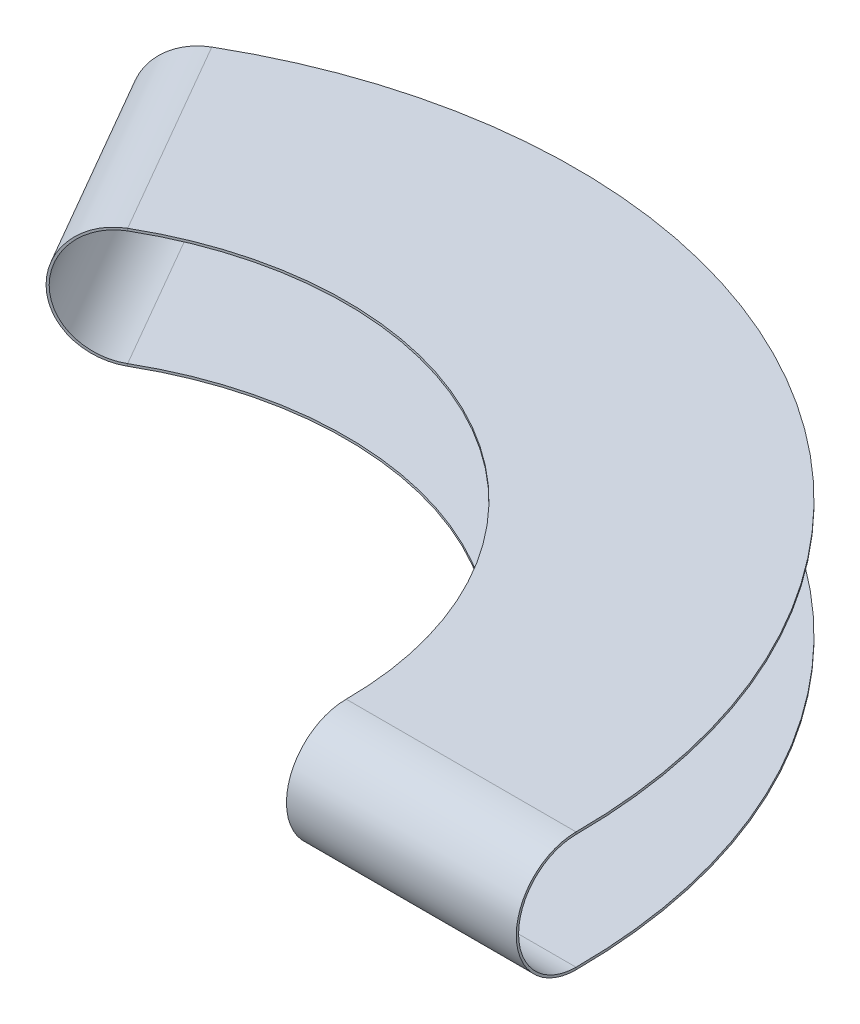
ISO-10303-21;
HEADER;
FILE_DESCRIPTION(('STEP AP214'),'2;1');
FILE_NAME('part.step','',(''),(''),'','','');
FILE_SCHEMA(('AUTOMOTIVE_DESIGN { 1 0 10303 214 1 1 1 1 }'));
ENDSEC;
DATA;
#1=APPLICATION_CONTEXT('core data for automotive mechanical design processes');
#2=APPLICATION_PROTOCOL_DEFINITION('international standard','automotive_design',2000,#1);
#3=PRODUCT_CONTEXT('',#1,'mechanical');
#4=PRODUCT('Part','Part','',(#3));
#5=PRODUCT_RELATED_PRODUCT_CATEGORY('part','',(#4));
#6=PRODUCT_DEFINITION_FORMATION('','',#4);
#7=PRODUCT_DEFINITION_CONTEXT('part definition',#1,'design');
#8=PRODUCT_DEFINITION('design','',#6,#7);
#9=PRODUCT_DEFINITION_SHAPE('','',#8);
#10=(LENGTH_UNIT() NAMED_UNIT(*) SI_UNIT(.MILLI.,.METRE.));
#11=(NAMED_UNIT(*) PLANE_ANGLE_UNIT() SI_UNIT($,.RADIAN.));
#12=(NAMED_UNIT(*) SI_UNIT($,.STERADIAN.) SOLID_ANGLE_UNIT());
#13=UNCERTAINTY_MEASURE_WITH_UNIT(LENGTH_MEASURE(1.E-05),#10,'distance_accuracy_value','');
#14=(GEOMETRIC_REPRESENTATION_CONTEXT(3) GLOBAL_UNCERTAINTY_ASSIGNED_CONTEXT((#13)) GLOBAL_UNIT_ASSIGNED_CONTEXT((#10,
#11,#12)) REPRESENTATION_CONTEXT('',''));
#15=CARTESIAN_POINT('',(0.,0.,0.));
#16=DIRECTION('',(0.,0.,1.));
#17=DIRECTION('',(1.,0.,0.));
#18=AXIS2_PLACEMENT_3D('',#15,#16,#17);
#19=CARTESIAN_POINT('',(0.,100.,0.));
#20=DIRECTION('',(0.,-1.,0.));
#21=DIRECTION('',(0.,0.,-1.));
#22=AXIS2_PLACEMENT_3D('',#19,#20,#21);
#23=CYLINDRICAL_SURFACE('',#22,300.);
#24=CARTESIAN_POINT('',(0.,0.,0.));
#25=DIRECTION('',(0.,-1.,0.));
#26=DIRECTION('',(0.,0.,1.));
#27=AXIS2_PLACEMENT_3D('',#24,#25,#26);
#28=CIRCLE('',#27,300.);
#29=CARTESIAN_POINT('',(-150.000000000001,0.,-259.807621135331));
#30=VERTEX_POINT('',#29);
#31=CARTESIAN_POINT('',(300.,0.,0.));
#32=VERTEX_POINT('',#31);
#33=EDGE_CURVE('E515',#30,#32,#28,.T.);
#34=ORIENTED_EDGE('',*,*,#33,.F.);
#35=DIRECTION('',(0.,-1.,0.));
#36=VECTOR('',#35,1.);
#37=CARTESIAN_POINT('',(-150.000000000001,100.,-259.807621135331));
#38=LINE('',#37,#36);
#39=CARTESIAN_POINT('',(-150.000000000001,-2.,-259.807621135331));
#40=VERTEX_POINT('',#39);
#41=EDGE_CURVE('E534',#30,#40,#38,.T.);
#42=ORIENTED_EDGE('',*,*,#41,.T.);
#43=CARTESIAN_POINT('',(0.,-2.,0.));
#44=DIRECTION('',(0.,1.,0.));
#45=DIRECTION('',(0.,0.,1.));
#46=AXIS2_PLACEMENT_3D('',#43,#44,#45);
#47=CIRCLE('',#46,300.);
#48=CARTESIAN_POINT('',(300.,-2.,0.));
#49=VERTEX_POINT('',#48);
#50=EDGE_CURVE('E566',#40,#49,#47,.F.);
#51=ORIENTED_EDGE('',*,*,#50,.T.);
#52=DIRECTION('',(0.,-1.,0.));
#53=VECTOR('',#52,1.);
#54=CARTESIAN_POINT('',(300.,100.,0.));
#55=LINE('',#54,#53);
#56=EDGE_CURVE('E454',#32,#49,#55,.T.);
#57=ORIENTED_EDGE('',*,*,#56,.F.);
#58=EDGE_LOOP('',(#34,#42,#51,#57));
#59=FACE_BOUND('',#58,.T.);
#60=ADVANCED_FACE('F445',(#59),#23,.F.);
#61=CARTESIAN_POINT('',(0.,100.,0.));
#62=DIRECTION('',(0.,-1.,0.));
#63=DIRECTION('',(0.,0.,-1.));
#64=AXIS2_PLACEMENT_3D('',#61,#62,#63);
#65=CYLINDRICAL_SURFACE('',#64,500.);
#66=CARTESIAN_POINT('',(0.,0.,0.));
#67=DIRECTION('',(0.,1.,0.));
#68=DIRECTION('',(0.,0.,1.));
#69=AXIS2_PLACEMENT_3D('',#66,#67,#68);
#70=CIRCLE('',#69,500.);
#71=CARTESIAN_POINT('',(500.,0.,0.));
#72=VERTEX_POINT('',#71);
#73=CARTESIAN_POINT('',(-250.000000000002,0.,-433.012701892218));
#74=VERTEX_POINT('',#73);
#75=EDGE_CURVE('E518',#72,#74,#70,.T.);
#76=ORIENTED_EDGE('',*,*,#75,.F.);
#77=DIRECTION('',(0.,-1.,0.));
#78=VECTOR('',#77,1.);
#79=CARTESIAN_POINT('',(500.,100.,0.));
#80=LINE('',#79,#78);
#81=CARTESIAN_POINT('',(500.,-2.,0.));
#82=VERTEX_POINT('',#81);
#83=EDGE_CURVE('E555',#72,#82,#80,.T.);
#84=ORIENTED_EDGE('',*,*,#83,.T.);
#85=CARTESIAN_POINT('',(0.,-2.,0.));
#86=DIRECTION('',(0.,1.,0.));
#87=DIRECTION('',(0.,0.,1.));
#88=AXIS2_PLACEMENT_3D('',#85,#86,#87);
#89=CIRCLE('',#88,500.);
#90=CARTESIAN_POINT('',(-250.000000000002,-2.,-433.012701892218));
#91=VERTEX_POINT('',#90);
#92=EDGE_CURVE('E565',#82,#91,#89,.T.);
#93=ORIENTED_EDGE('',*,*,#92,.T.);
#94=DIRECTION('',(0.,-1.,0.));
#95=VECTOR('',#94,1.);
#96=CARTESIAN_POINT('',(-250.000000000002,100.,-433.012701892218));
#97=LINE('',#96,#95);
#98=EDGE_CURVE('E546',#74,#91,#97,.T.);
#99=ORIENTED_EDGE('',*,*,#98,.F.);
#100=EDGE_LOOP('',(#76,#84,#93,#99));
#101=FACE_BOUND('',#100,.T.);
#102=ADVANCED_FACE('F584',(#101),#65,.T.);
#103=CARTESIAN_POINT('',(500.,50.,0.));
#104=DIRECTION('',(-1.,0.,0.));
#105=DIRECTION('',(0.,0.,1.));
#106=AXIS2_PLACEMENT_3D('',#103,#104,#105);
#107=PLANE('',#106);
#108=CARTESIAN_POINT('',(500.,50.,0.));
#109=DIRECTION('',(1.,0.,0.));
#110=DIRECTION('',(0.,0.,1.));
#111=AXIS2_PLACEMENT_3D('',#108,#109,#110);
#112=CIRCLE('',#111,50.);
#113=CARTESIAN_POINT('',(500.,100.,0.));
#114=VERTEX_POINT('',#113);
#115=EDGE_CURVE('E537',#114,#72,#112,.T.);
#116=ORIENTED_EDGE('',*,*,#115,.F.);
#117=CARTESIAN_POINT('',(500.,102.,0.));
#118=VERTEX_POINT('',#117);
#119=EDGE_CURVE('E552',#118,#114,#80,.T.);
#120=ORIENTED_EDGE('',*,*,#119,.F.);
#121=CARTESIAN_POINT('',(500.,50.,0.));
#122=DIRECTION('',(-1.,0.,0.));
#123=DIRECTION('',(0.,0.,1.));
#124=AXIS2_PLACEMENT_3D('',#121,#122,#123);
#125=CIRCLE('',#124,52.);
#126=EDGE_CURVE('E573',#118,#82,#125,.F.);
#127=ORIENTED_EDGE('',*,*,#126,.T.);
#128=ORIENTED_EDGE('',*,*,#83,.F.);
#129=EDGE_LOOP('',(#116,#120,#127,#128));
#130=FACE_BOUND('',#129,.T.);
#131=ADVANCED_FACE('F616',(#130),#107,.F.);
#132=CARTESIAN_POINT('',(300.,50.,0.));
#133=DIRECTION('',(-1.,0.,0.));
#134=DIRECTION('',(0.,0.,1.));
#135=AXIS2_PLACEMENT_3D('',#132,#133,#134);
#136=PLANE('',#135);
#137=CARTESIAN_POINT('',(300.,102.,0.));
#138=VERTEX_POINT('',#137);
#139=CARTESIAN_POINT('',(300.,100.,0.));
#140=VERTEX_POINT('',#139);
#141=EDGE_CURVE('E11',#138,#140,#55,.T.);
#142=ORIENTED_EDGE('',*,*,#141,.T.);
#143=CARTESIAN_POINT('',(300.,50.,0.));
#144=DIRECTION('',(1.,0.,0.));
#145=DIRECTION('',(0.,0.,1.));
#146=AXIS2_PLACEMENT_3D('',#143,#144,#145);
#147=CIRCLE('',#146,50.);
#148=EDGE_CURVE('E597',#140,#32,#147,.T.);
#149=ORIENTED_EDGE('',*,*,#148,.T.);
#150=ORIENTED_EDGE('',*,*,#56,.T.);
#151=CARTESIAN_POINT('',(300.,50.,0.));
#152=DIRECTION('',(-1.,0.,0.));
#153=DIRECTION('',(0.,0.,1.));
#154=AXIS2_PLACEMENT_3D('',#151,#152,#153);
#155=CIRCLE('',#154,52.);
#156=EDGE_CURVE('E574',#138,#49,#155,.F.);
#157=ORIENTED_EDGE('',*,*,#156,.F.);
#158=EDGE_LOOP('',(#142,#149,#150,#157));
#159=FACE_BOUND('',#158,.T.);
#160=ADVANCED_FACE('F627',(#159),#136,.T.);
#161=CARTESIAN_POINT('',(-150.000000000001,102.,-259.807621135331));
#162=VERTEX_POINT('',#161);
#163=CARTESIAN_POINT('',(-150.000000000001,100.,-259.807621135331));
#164=VERTEX_POINT('',#163);
#165=EDGE_CURVE('E543',#162,#164,#38,.T.);
#166=ORIENTED_EDGE('',*,*,#165,.T.);
#167=CARTESIAN_POINT('',(0.,100.,0.));
#168=DIRECTION('',(0.,-1.,0.));
#169=DIRECTION('',(0.,0.,1.));
#170=AXIS2_PLACEMENT_3D('',#167,#168,#169);
#171=CIRCLE('',#170,300.);
#172=EDGE_CURVE('E470',#164,#140,#171,.T.);
#173=ORIENTED_EDGE('',*,*,#172,.T.);
#174=ORIENTED_EDGE('',*,*,#141,.F.);
#175=CARTESIAN_POINT('',(0.,102.,0.));
#176=DIRECTION('',(0.,1.,0.));
#177=DIRECTION('',(0.,0.,1.));
#178=AXIS2_PLACEMENT_3D('',#175,#176,#177);
#179=CIRCLE('',#178,300.);
#180=EDGE_CURVE('E560',#162,#138,#179,.F.);
#181=ORIENTED_EDGE('',*,*,#180,.F.);
#182=EDGE_LOOP('',(#166,#173,#174,#181));
#183=FACE_BOUND('',#182,.T.);
#184=ADVANCED_FACE('F623',(#183),#23,.F.);
#185=ORIENTED_EDGE('',*,*,#119,.T.);
#186=CARTESIAN_POINT('',(0.,100.,0.));
#187=DIRECTION('',(0.,1.,0.));
#188=DIRECTION('',(0.,0.,1.));
#189=AXIS2_PLACEMENT_3D('',#186,#187,#188);
#190=CIRCLE('',#189,500.);
#191=CARTESIAN_POINT('',(-250.000000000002,100.,-433.012701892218));
#192=VERTEX_POINT('',#191);
#193=EDGE_CURVE('E606',#114,#192,#190,.T.);
#194=ORIENTED_EDGE('',*,*,#193,.T.);
#195=CARTESIAN_POINT('',(-250.000000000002,102.,-433.012701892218));
#196=VERTEX_POINT('',#195);
#197=EDGE_CURVE('E556',#196,#192,#97,.T.);
#198=ORIENTED_EDGE('',*,*,#197,.F.);
#199=CARTESIAN_POINT('',(0.,102.,0.));
#200=DIRECTION('',(0.,1.,0.));
#201=DIRECTION('',(0.,0.,1.));
#202=AXIS2_PLACEMENT_3D('',#199,#200,#201);
#203=CIRCLE('',#202,500.);
#204=EDGE_CURVE('E547',#118,#196,#203,.T.);
#205=ORIENTED_EDGE('',*,*,#204,.F.);
#206=EDGE_LOOP('',(#185,#194,#198,#205));
#207=FACE_BOUND('',#206,.T.);
#208=ADVANCED_FACE('F609',(#207),#65,.T.);
#209=CARTESIAN_POINT('',(0.,102.,0.));
#210=DIRECTION('',(0.,1.,0.));
#211=DIRECTION('',(0.,0.,1.));
#212=AXIS2_PLACEMENT_3D('',#209,#210,#211);
#213=PLANE('',#212);
#214=ORIENTED_EDGE('',*,*,#180,.T.);
#215=DIRECTION('',(1.,0.,0.));
#216=VECTOR('',#215,1.);
#217=CARTESIAN_POINT('',(0.,102.,0.));
#218=LINE('',#217,#216);
#219=EDGE_CURVE('E559',#138,#118,#218,.T.);
#220=ORIENTED_EDGE('',*,*,#219,.T.);
#221=ORIENTED_EDGE('',*,*,#204,.T.);
#222=DIRECTION('',(0.500000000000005,0.,0.866025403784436));
#223=VECTOR('',#222,1.);
#224=CARTESIAN_POINT('',(-250.000000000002,102.,-433.012701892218));
#225=LINE('',#224,#223);
#226=EDGE_CURVE('E544',#196,#162,#225,.T.);
#227=ORIENTED_EDGE('',*,*,#226,.T.);
#228=EDGE_LOOP('',(#214,#220,#221,#227));
#229=FACE_BOUND('',#228,.T.);
#230=ADVANCED_FACE('F631',(#229),#213,.T.);
#231=CARTESIAN_POINT('',(0.,-2.,0.));
#232=DIRECTION('',(0.,1.,0.));
#233=DIRECTION('',(0.,0.,1.));
#234=AXIS2_PLACEMENT_3D('',#231,#232,#233);
#235=PLANE('',#234);
#236=ORIENTED_EDGE('',*,*,#50,.F.);
#237=DIRECTION('',(0.500000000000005,0.,0.866025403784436));
#238=VECTOR('',#237,1.);
#239=CARTESIAN_POINT('',(-250.000000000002,-2.,-433.012701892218));
#240=LINE('',#239,#238);
#241=EDGE_CURVE('E567',#91,#40,#240,.T.);
#242=ORIENTED_EDGE('',*,*,#241,.F.);
#243=ORIENTED_EDGE('',*,*,#92,.F.);
#244=DIRECTION('',(-1.,0.,0.));
#245=VECTOR('',#244,1.);
#246=CARTESIAN_POINT('',(500.,-2.,0.));
#247=LINE('',#246,#245);
#248=EDGE_CURVE('E562',#49,#82,#247,.F.);
#249=ORIENTED_EDGE('',*,*,#248,.F.);
#250=EDGE_LOOP('',(#236,#242,#243,#249));
#251=FACE_BOUND('',#250,.T.);
#252=ADVANCED_FACE('F589',(#251),#235,.F.);
#253=CARTESIAN_POINT('',(500.,50.,0.));
#254=DIRECTION('',(-1.,0.,0.));
#255=DIRECTION('',(0.,0.,1.));
#256=AXIS2_PLACEMENT_3D('',#253,#254,#255);
#257=CYLINDRICAL_SURFACE('',#256,52.);
#258=ORIENTED_EDGE('',*,*,#156,.T.);
#259=ORIENTED_EDGE('',*,*,#248,.T.);
#260=ORIENTED_EDGE('',*,*,#126,.F.);
#261=ORIENTED_EDGE('',*,*,#219,.F.);
#262=EDGE_LOOP('',(#258,#259,#260,#261));
#263=FACE_BOUND('',#262,.T.);
#264=ADVANCED_FACE('F629',(#263),#257,.T.);
#265=CARTESIAN_POINT('',(-250.000000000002,50.,-433.012701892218));
#266=DIRECTION('',(0.500000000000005,0.,0.866025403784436));
#267=DIRECTION('',(0.866025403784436,0.,-0.500000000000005));
#268=AXIS2_PLACEMENT_3D('',#265,#266,#267);
#269=CYLINDRICAL_SURFACE('',#268,52.);
#270=CARTESIAN_POINT('',(-150.000000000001,50.,-259.807621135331));
#271=DIRECTION('',(0.500000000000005,0.,0.866025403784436));
#272=DIRECTION('',(0.866025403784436,0.,-0.500000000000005));
#273=AXIS2_PLACEMENT_3D('',#270,#271,#272);
#274=CIRCLE('',#273,52.);
#275=EDGE_CURVE('E542',#162,#40,#274,.T.);
#276=ORIENTED_EDGE('',*,*,#275,.F.);
#277=ORIENTED_EDGE('',*,*,#226,.F.);
#278=CARTESIAN_POINT('',(-250.000000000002,50.,-433.012701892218));
#279=DIRECTION('',(0.500000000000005,0.,0.866025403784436));
#280=DIRECTION('',(0.866025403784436,0.,-0.500000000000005));
#281=AXIS2_PLACEMENT_3D('',#278,#279,#280);
#282=CIRCLE('',#281,52.);
#283=EDGE_CURVE('E449',#196,#91,#282,.T.);
#284=ORIENTED_EDGE('',*,*,#283,.T.);
#285=ORIENTED_EDGE('',*,*,#241,.T.);
#286=EDGE_LOOP('',(#276,#277,#284,#285));
#287=FACE_BOUND('',#286,.T.);
#288=ADVANCED_FACE('F447',(#287),#269,.T.);
#289=CARTESIAN_POINT('',(-250.000000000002,50.,-433.012701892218));
#290=DIRECTION('',(0.500000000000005,0.,0.866025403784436));
#291=DIRECTION('',(0.866025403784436,0.,-0.500000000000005));
#292=AXIS2_PLACEMENT_3D('',#289,#290,#291);
#293=PLANE('',#292);
#294=ORIENTED_EDGE('',*,*,#197,.T.);
#295=CARTESIAN_POINT('',(-250.000000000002,50.,-433.012701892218));
#296=DIRECTION('',(0.500000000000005,0.,0.866025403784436));
#297=DIRECTION('',(0.866025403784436,0.,-0.500000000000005));
#298=AXIS2_PLACEMENT_3D('',#295,#296,#297);
#299=CIRCLE('',#298,50.);
#300=EDGE_CURVE('E529',#192,#74,#299,.T.);
#301=ORIENTED_EDGE('',*,*,#300,.T.);
#302=ORIENTED_EDGE('',*,*,#98,.T.);
#303=ORIENTED_EDGE('',*,*,#283,.F.);
#304=EDGE_LOOP('',(#294,#301,#302,#303));
#305=FACE_BOUND('',#304,.T.);
#306=ADVANCED_FACE('F594',(#305),#293,.F.);
#307=CARTESIAN_POINT('',(-150.000000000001,50.,-259.807621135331));
#308=DIRECTION('',(0.500000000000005,0.,0.866025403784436));
#309=DIRECTION('',(0.866025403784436,0.,-0.500000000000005));
#310=AXIS2_PLACEMENT_3D('',#307,#308,#309);
#311=PLANE('',#310);
#312=CARTESIAN_POINT('',(-150.000000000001,50.,-259.807621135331));
#313=DIRECTION('',(0.500000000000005,0.,0.866025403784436));
#314=DIRECTION('',(0.866025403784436,0.,-0.500000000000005));
#315=AXIS2_PLACEMENT_3D('',#312,#313,#314);
#316=CIRCLE('',#315,50.);
#317=EDGE_CURVE('E522',#164,#30,#316,.T.);
#318=ORIENTED_EDGE('',*,*,#317,.F.);
#319=ORIENTED_EDGE('',*,*,#165,.F.);
#320=ORIENTED_EDGE('',*,*,#275,.T.);
#321=ORIENTED_EDGE('',*,*,#41,.F.);
#322=EDGE_LOOP('',(#318,#319,#320,#321));
#323=FACE_BOUND('',#322,.T.);
#324=ADVANCED_FACE('F540',(#323),#311,.T.);
#325=CARTESIAN_POINT('',(0.,100.,0.));
#326=DIRECTION('',(0.,1.,0.));
#327=DIRECTION('',(0.,0.,1.));
#328=AXIS2_PLACEMENT_3D('',#325,#326,#327);
#329=PLANE('',#328);
#330=ORIENTED_EDGE('',*,*,#172,.F.);
#331=DIRECTION('',(0.500000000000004,0.,0.866025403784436));
#332=VECTOR('',#331,1.);
#333=CARTESIAN_POINT('',(-250.000000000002,100.,-433.012701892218));
#334=LINE('',#333,#332);
#335=EDGE_CURVE('E524',#192,#164,#334,.T.);
#336=ORIENTED_EDGE('',*,*,#335,.F.);
#337=ORIENTED_EDGE('',*,*,#193,.F.);
#338=DIRECTION('',(1.,0.,0.));
#339=VECTOR('',#338,1.);
#340=CARTESIAN_POINT('',(300.,100.,0.));
#341=LINE('',#340,#339);
#342=EDGE_CURVE('E605',#140,#114,#341,.T.);
#343=ORIENTED_EDGE('',*,*,#342,.F.);
#344=EDGE_LOOP('',(#330,#336,#337,#343));
#345=FACE_BOUND('',#344,.T.);
#346=ADVANCED_FACE('F613',(#345),#329,.F.);
#347=CARTESIAN_POINT('',(0.,0.,0.));
#348=DIRECTION('',(0.,1.,0.));
#349=DIRECTION('',(0.,0.,1.));
#350=AXIS2_PLACEMENT_3D('',#347,#348,#349);
#351=PLANE('',#350);
#352=ORIENTED_EDGE('',*,*,#33,.T.);
#353=DIRECTION('',(1.,0.,0.));
#354=VECTOR('',#353,1.);
#355=CARTESIAN_POINT('',(300.,0.,0.));
#356=LINE('',#355,#354);
#357=EDGE_CURVE('E536',#32,#72,#356,.T.);
#358=ORIENTED_EDGE('',*,*,#357,.T.);
#359=ORIENTED_EDGE('',*,*,#75,.T.);
#360=DIRECTION('',(0.500000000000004,0.,0.866025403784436));
#361=VECTOR('',#360,1.);
#362=CARTESIAN_POINT('',(-250.000000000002,0.,-433.012701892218));
#363=LINE('',#362,#361);
#364=EDGE_CURVE('E462',#74,#30,#363,.T.);
#365=ORIENTED_EDGE('',*,*,#364,.T.);
#366=EDGE_LOOP('',(#352,#358,#359,#365));
#367=FACE_BOUND('',#366,.T.);
#368=ADVANCED_FACE('F512',(#367),#351,.T.);
#369=CARTESIAN_POINT('',(500.,50.,0.));
#370=DIRECTION('',(-1.,0.,0.));
#371=DIRECTION('',(0.,0.,1.));
#372=AXIS2_PLACEMENT_3D('',#369,#370,#371);
#373=CYLINDRICAL_SURFACE('',#372,50.);
#374=ORIENTED_EDGE('',*,*,#148,.F.);
#375=ORIENTED_EDGE('',*,*,#342,.T.);
#376=ORIENTED_EDGE('',*,*,#115,.T.);
#377=ORIENTED_EDGE('',*,*,#357,.F.);
#378=EDGE_LOOP('',(#374,#375,#376,#377));
#379=FACE_BOUND('',#378,.T.);
#380=ADVANCED_FACE('F619',(#379),#373,.F.);
#381=CARTESIAN_POINT('',(-250.000000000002,50.,-433.012701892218));
#382=DIRECTION('',(0.500000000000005,0.,0.866025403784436));
#383=DIRECTION('',(0.866025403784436,0.,-0.500000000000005));
#384=AXIS2_PLACEMENT_3D('',#381,#382,#383);
#385=CYLINDRICAL_SURFACE('',#384,50.);
#386=ORIENTED_EDGE('',*,*,#317,.T.);
#387=ORIENTED_EDGE('',*,*,#364,.F.);
#388=ORIENTED_EDGE('',*,*,#300,.F.);
#389=ORIENTED_EDGE('',*,*,#335,.T.);
#390=EDGE_LOOP('',(#386,#387,#388,#389));
#391=FACE_BOUND('',#390,.T.);
#392=ADVANCED_FACE('F523',(#391),#385,.F.);
#393=CLOSED_SHELL('',(#60,#102,#131,#160,#184,#208,#230,#252,#264,#288,#306,#324,#346,#368,#380,#392));
#394=MANIFOLD_SOLID_BREP('B2',#393);
#395=ADVANCED_BREP_SHAPE_REPRESENTATION('',(#18,#394),#14);
#396=SHAPE_DEFINITION_REPRESENTATION(#9,#395);
ENDSEC;
END-ISO-10303-21;
